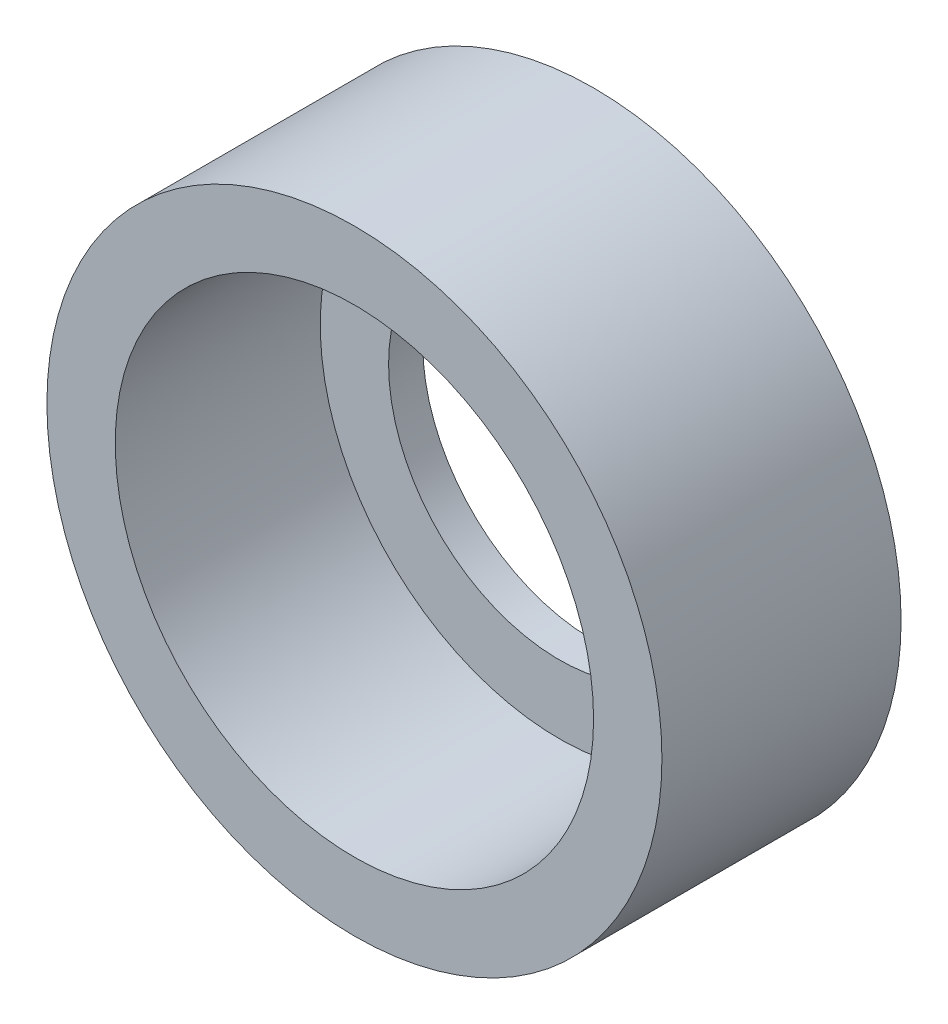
from build123d import *

# Parameters (mm, degrees)
ESQUISSE1_R               = 4.5
EXTRUSION1_DEPTH          = 3.5
TROU_TARAUD_M8X1_01_D     = 7
TROU_TARAUD_M8X1_01_DEPTH = 3
ESQUISSE4_R               = 2.5
ENL_V_MAT_EXTRU_1_DEPTH   = 8.262919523


with BuildPart() as part:
    # Esquisse1 → Extrusion1 (new body)
    with BuildSketch(Plane.XY):
        Circle(ESQUISSE1_R)
    extrude(amount=EXTRUSION1_DEPTH)

    # Trou taraud_ M8x1.01
    with Locations(Plane.XY.offset(3.5)):
        with Locations((0, 0)):
            Hole(TROU_TARAUD_M8X1_01_D / 2, depth=TROU_TARAUD_M8X1_01_DEPTH)

    # Esquisse4 → Enl_v. mat.-Extru.1 (cut, through all)
    with BuildSketch(Plane(origin=(0, 0, 0), x_dir=(-1, 0, 0), z_dir=(0, 0, -1))):
        Circle(ESQUISSE4_R)
    extrude(amount=-ENL_V_MAT_EXTRU_1_DEPTH, mode=Mode.SUBTRACT)


solid = part.part
